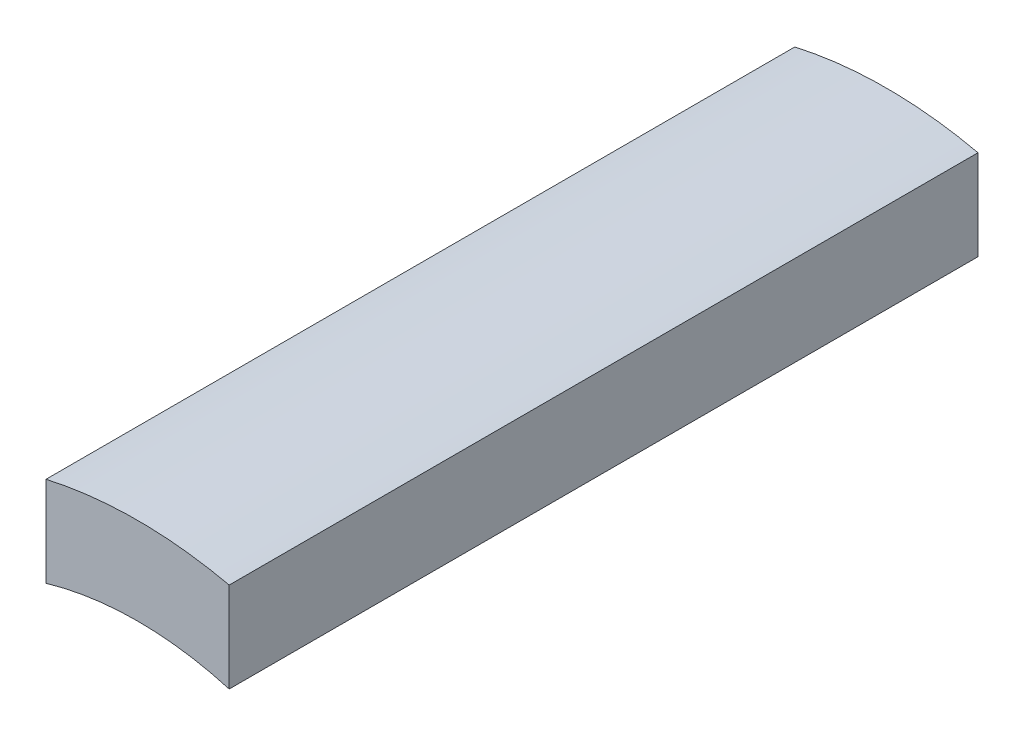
ISO-10303-21;
HEADER;
FILE_DESCRIPTION(('STEP AP214'),'2;1');
FILE_NAME('part.step','',(''),(''),'','','');
FILE_SCHEMA(('AUTOMOTIVE_DESIGN { 1 0 10303 214 1 1 1 1 }'));
ENDSEC;
DATA;
#1=APPLICATION_CONTEXT('core data for automotive mechanical design processes');
#2=APPLICATION_PROTOCOL_DEFINITION('international standard','automotive_design',2000,#1);
#3=PRODUCT_CONTEXT('',#1,'mechanical');
#4=PRODUCT('Part','Part','',(#3));
#5=PRODUCT_RELATED_PRODUCT_CATEGORY('part','',(#4));
#6=PRODUCT_DEFINITION_FORMATION('','',#4);
#7=PRODUCT_DEFINITION_CONTEXT('part definition',#1,'design');
#8=PRODUCT_DEFINITION('design','',#6,#7);
#9=PRODUCT_DEFINITION_SHAPE('','',#8);
#10=(LENGTH_UNIT() NAMED_UNIT(*) SI_UNIT(.MILLI.,.METRE.));
#11=(NAMED_UNIT(*) PLANE_ANGLE_UNIT() SI_UNIT($,.RADIAN.));
#12=(NAMED_UNIT(*) SI_UNIT($,.STERADIAN.) SOLID_ANGLE_UNIT());
#13=UNCERTAINTY_MEASURE_WITH_UNIT(LENGTH_MEASURE(1.E-05),#10,'distance_accuracy_value','');
#14=(GEOMETRIC_REPRESENTATION_CONTEXT(3) GLOBAL_UNCERTAINTY_ASSIGNED_CONTEXT((#13)) GLOBAL_UNIT_ASSIGNED_CONTEXT((#10,
#11,#12)) REPRESENTATION_CONTEXT('',''));
#15=CARTESIAN_POINT('',(0.,0.,0.));
#16=DIRECTION('',(0.,0.,1.));
#17=DIRECTION('',(1.,0.,0.));
#18=AXIS2_PLACEMENT_3D('',#15,#16,#17);
#19=CARTESIAN_POINT('',(0.,0.,51.5));
#20=DIRECTION('',(0.,0.,-1.));
#21=DIRECTION('',(-1.,0.,0.));
#22=AXIS2_PLACEMENT_3D('',#19,#20,#21);
#23=CYLINDRICAL_SURFACE('',#22,28.5);
#24=CARTESIAN_POINT('',(0.,0.,0.));
#25=DIRECTION('',(0.,0.,1.));
#26=DIRECTION('',(1.,0.,0.));
#27=AXIS2_PLACEMENT_3D('',#24,#25,#26);
#28=CIRCLE('',#27,28.5);
#29=CARTESIAN_POINT('',(6.3,27.7949635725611,0.));
#30=VERTEX_POINT('',#29);
#31=CARTESIAN_POINT('',(-6.3,27.7949635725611,0.));
#32=VERTEX_POINT('',#31);
#33=EDGE_CURVE('E99',#30,#32,#28,.T.);
#34=ORIENTED_EDGE('',*,*,#33,.T.);
#35=DIRECTION('',(0.,0.,-1.));
#36=VECTOR('',#35,1.);
#37=CARTESIAN_POINT('',(-6.3,27.7949635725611,51.5));
#38=LINE('',#37,#36);
#39=CARTESIAN_POINT('',(-6.3,27.7949635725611,51.5));
#40=VERTEX_POINT('',#39);
#41=EDGE_CURVE('E11',#40,#32,#38,.T.);
#42=ORIENTED_EDGE('',*,*,#41,.F.);
#43=CARTESIAN_POINT('',(0.,0.,51.5));
#44=DIRECTION('',(0.,0.,1.));
#45=DIRECTION('',(1.,0.,0.));
#46=AXIS2_PLACEMENT_3D('',#43,#44,#45);
#47=CIRCLE('',#46,28.5);
#48=CARTESIAN_POINT('',(6.3,27.7949635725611,51.5));
#49=VERTEX_POINT('',#48);
#50=EDGE_CURVE('E87',#49,#40,#47,.T.);
#51=ORIENTED_EDGE('',*,*,#50,.F.);
#52=DIRECTION('',(0.,0.,-1.));
#53=VECTOR('',#52,1.);
#54=CARTESIAN_POINT('',(6.3,27.7949635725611,51.5));
#55=LINE('',#54,#53);
#56=EDGE_CURVE('E95',#49,#30,#55,.T.);
#57=ORIENTED_EDGE('',*,*,#56,.T.);
#58=EDGE_LOOP('',(#34,#42,#51,#57));
#59=FACE_BOUND('',#58,.T.);
#60=ADVANCED_FACE('F36',(#59),#23,.T.);
#61=CARTESIAN_POINT('',(-6.3,21.6,51.5));
#62=DIRECTION('',(1.,0.,0.));
#63=DIRECTION('',(0.,0.,-1.));
#64=AXIS2_PLACEMENT_3D('',#61,#62,#63);
#65=PLANE('',#64);
#66=DIRECTION('',(0.,-1.,0.));
#67=VECTOR('',#66,1.);
#68=CARTESIAN_POINT('',(-6.3,21.6,0.));
#69=LINE('',#68,#67);
#70=CARTESIAN_POINT('',(-6.3,21.6,0.));
#71=VERTEX_POINT('',#70);
#72=EDGE_CURVE('E91',#32,#71,#69,.T.);
#73=ORIENTED_EDGE('',*,*,#72,.T.);
#74=DIRECTION('',(0.,0.,-1.));
#75=VECTOR('',#74,1.);
#76=CARTESIAN_POINT('',(-6.3,21.6,51.5));
#77=LINE('',#76,#75);
#78=CARTESIAN_POINT('',(-6.3,21.6,51.5));
#79=VERTEX_POINT('',#78);
#80=EDGE_CURVE('E44',#79,#71,#77,.T.);
#81=ORIENTED_EDGE('',*,*,#80,.F.);
#82=DIRECTION('',(0.,-1.,0.));
#83=VECTOR('',#82,1.);
#84=CARTESIAN_POINT('',(-6.3,21.6,51.5));
#85=LINE('',#84,#83);
#86=EDGE_CURVE('E82',#40,#79,#85,.T.);
#87=ORIENTED_EDGE('',*,*,#86,.F.);
#88=ORIENTED_EDGE('',*,*,#41,.T.);
#89=EDGE_LOOP('',(#73,#81,#87,#88));
#90=FACE_BOUND('',#89,.T.);
#91=ADVANCED_FACE('F90',(#90),#65,.F.);
#92=CARTESIAN_POINT('',(0.,0.,51.5));
#93=DIRECTION('',(0.,0.,-1.));
#94=DIRECTION('',(-1.,0.,0.));
#95=AXIS2_PLACEMENT_3D('',#92,#93,#94);
#96=CYLINDRICAL_SURFACE('',#95,22.5);
#97=CARTESIAN_POINT('',(0.,0.,0.));
#98=DIRECTION('',(0.,0.,-1.));
#99=DIRECTION('',(1.,0.,0.));
#100=AXIS2_PLACEMENT_3D('',#97,#98,#99);
#101=CIRCLE('',#100,22.5);
#102=CARTESIAN_POINT('',(6.3,21.6,0.));
#103=VERTEX_POINT('',#102);
#104=EDGE_CURVE('E69',#71,#103,#101,.T.);
#105=ORIENTED_EDGE('',*,*,#104,.T.);
#106=DIRECTION('',(0.,0.,-1.));
#107=VECTOR('',#106,1.);
#108=CARTESIAN_POINT('',(6.3,21.6,51.5));
#109=LINE('',#108,#107);
#110=CARTESIAN_POINT('',(6.3,21.6,51.5));
#111=VERTEX_POINT('',#110);
#112=EDGE_CURVE('E92',#111,#103,#109,.T.);
#113=ORIENTED_EDGE('',*,*,#112,.F.);
#114=CARTESIAN_POINT('',(0.,0.,51.5));
#115=DIRECTION('',(0.,0.,-1.));
#116=DIRECTION('',(1.,0.,0.));
#117=AXIS2_PLACEMENT_3D('',#114,#115,#116);
#118=CIRCLE('',#117,22.5);
#119=EDGE_CURVE('E85',#79,#111,#118,.T.);
#120=ORIENTED_EDGE('',*,*,#119,.F.);
#121=ORIENTED_EDGE('',*,*,#80,.T.);
#122=EDGE_LOOP('',(#105,#113,#120,#121));
#123=FACE_BOUND('',#122,.T.);
#124=ADVANCED_FACE('F93',(#123),#96,.F.);
#125=CARTESIAN_POINT('',(6.3,21.6,51.5));
#126=DIRECTION('',(-1.,0.,0.));
#127=DIRECTION('',(0.,0.,1.));
#128=AXIS2_PLACEMENT_3D('',#125,#126,#127);
#129=PLANE('',#128);
#130=DIRECTION('',(0.,1.,0.));
#131=VECTOR('',#130,1.);
#132=CARTESIAN_POINT('',(6.3,21.6,0.));
#133=LINE('',#132,#131);
#134=EDGE_CURVE('E75',#103,#30,#133,.T.);
#135=ORIENTED_EDGE('',*,*,#134,.T.);
#136=ORIENTED_EDGE('',*,*,#56,.F.);
#137=DIRECTION('',(0.,1.,0.));
#138=VECTOR('',#137,1.);
#139=CARTESIAN_POINT('',(6.3,21.6,51.5));
#140=LINE('',#139,#138);
#141=EDGE_CURVE('E52',#111,#49,#140,.T.);
#142=ORIENTED_EDGE('',*,*,#141,.F.);
#143=ORIENTED_EDGE('',*,*,#112,.T.);
#144=EDGE_LOOP('',(#135,#136,#142,#143));
#145=FACE_BOUND('',#144,.T.);
#146=ADVANCED_FACE('F106',(#145),#129,.F.);
#147=CARTESIAN_POINT('',(0.,0.,51.5));
#148=DIRECTION('',(0.,0.,1.));
#149=DIRECTION('',(1.,0.,0.));
#150=AXIS2_PLACEMENT_3D('',#147,#148,#149);
#151=PLANE('',#150);
#152=ORIENTED_EDGE('',*,*,#50,.T.);
#153=ORIENTED_EDGE('',*,*,#86,.T.);
#154=ORIENTED_EDGE('',*,*,#119,.T.);
#155=ORIENTED_EDGE('',*,*,#141,.T.);
#156=EDGE_LOOP('',(#152,#153,#154,#155));
#157=FACE_BOUND('',#156,.T.);
#158=ADVANCED_FACE('F83',(#157),#151,.T.);
#159=CARTESIAN_POINT('',(0.,0.,0.));
#160=DIRECTION('',(0.,0.,1.));
#161=DIRECTION('',(1.,0.,0.));
#162=AXIS2_PLACEMENT_3D('',#159,#160,#161);
#163=PLANE('',#162);
#164=ORIENTED_EDGE('',*,*,#33,.F.);
#165=ORIENTED_EDGE('',*,*,#134,.F.);
#166=ORIENTED_EDGE('',*,*,#104,.F.);
#167=ORIENTED_EDGE('',*,*,#72,.F.);
#168=EDGE_LOOP('',(#164,#165,#166,#167));
#169=FACE_BOUND('',#168,.T.);
#170=ADVANCED_FACE('F109',(#169),#163,.F.);
#171=CLOSED_SHELL('',(#60,#91,#124,#146,#158,#170));
#172=MANIFOLD_SOLID_BREP('B2',#171);
#173=ADVANCED_BREP_SHAPE_REPRESENTATION('',(#18,#172),#14);
#174=SHAPE_DEFINITION_REPRESENTATION(#9,#173);
ENDSEC;
END-ISO-10303-21;
